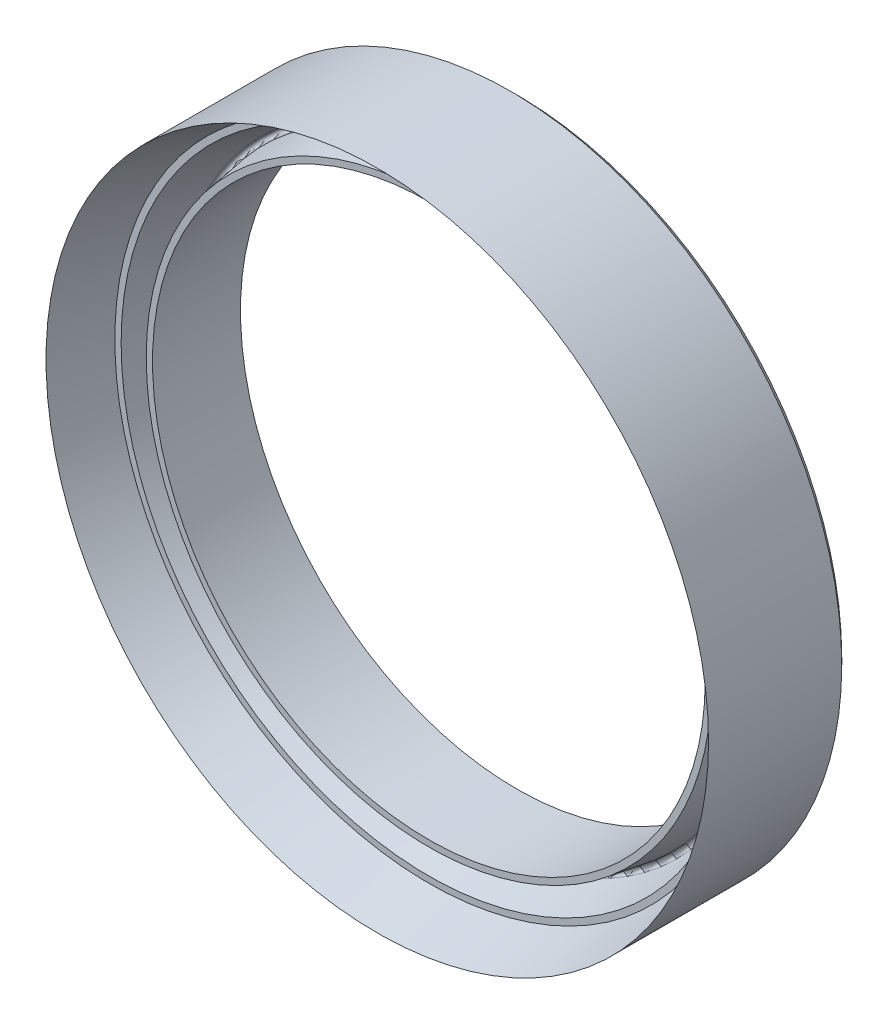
from build123d import *

# Parameters (mm, degrees)
CHANFREIN1_SIZE = 0.5


with BuildPart() as part:
    # Esquisse1 → Base-R_volution (revolve)
    with BuildSketch(Plane(origin=(0, 0, 0), x_dir=(0, 0, -1), z_dir=(1, 0, 0)), mode=Mode.PRIVATE) as base_r_volution_sk:
        with BuildLine():
            Line((0, 22), (0, 22.5))
            Line((0, 22.5), (3.079454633, 22.975642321))
            ThreePointArc((3.079454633, 22.975642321), (3.290406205, 23.201674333), (3.120349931, 23.459883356))
            Line((3.120349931, 23.459883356), (0, 24.5))
            Line((0, 24.5), (0, 25))
            Line((0, 25), (-4.106250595, 26.368750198))
            Line((-4.106250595, 26.368750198), (7, 26.368750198))
            Line((7, 26.368750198), (7, 22))
            Line((7, 22), (0, 22))
        make_face()
    revolve(base_r_volution_sk.sketch.rotate(Axis((0, 0, 20), (0, 0, -1)), 90), axis=Axis((0, 0, 20), (0, 0, -1)))

    # Chanfrein1
    chanfrein1_edges = [part.edges().sort_by_distance(p)[0] for p in [
        (-26.368750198, 0, -7),
    ]]
    chamfer(chanfrein1_edges, length=CHANFREIN1_SIZE)


solid = part.part
